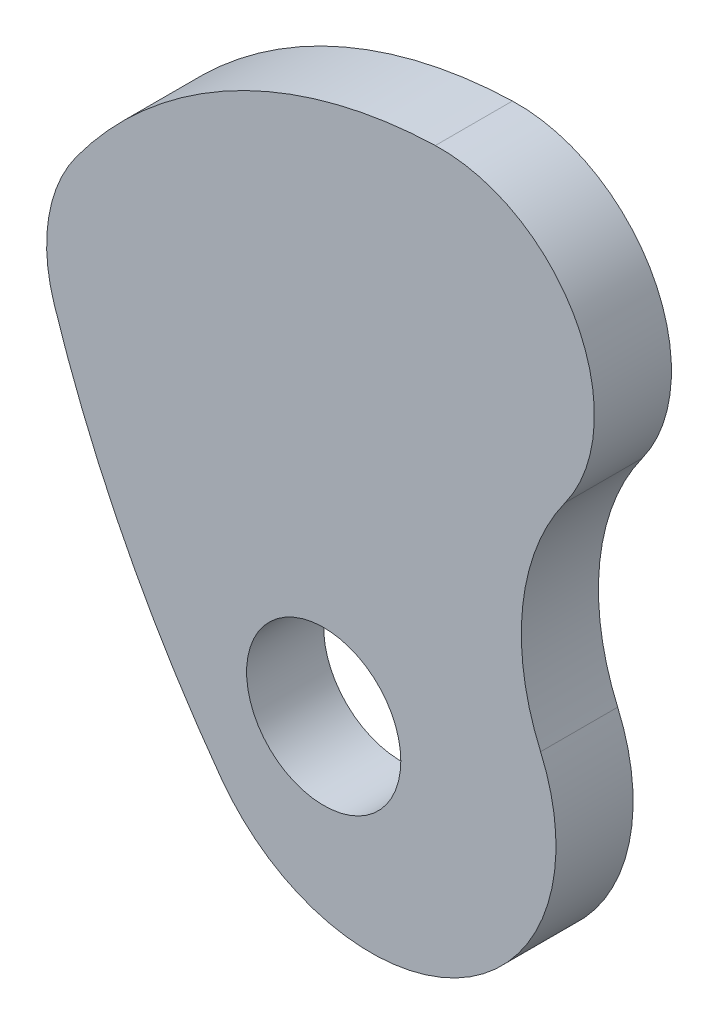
from build123d import *

# Parameters (mm, degrees)
SKETCH1_R      = 5
EXTRUDE2_DEPTH = 5


with BuildPart() as part:
    # Sketch1 → Extrude2 (new body)
    with BuildSketch(Plane.XY):
        with BuildLine():
            ThreePointArc((-17.482435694, 14.437829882), (-12.901534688, 3.368679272), (-6.616664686, -6.829906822))
            ThreePointArc((-6.616664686, -6.829906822), (9.043339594, -10.142686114), (14.064444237, 5.055956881))
            ThreePointArc((14.064444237, 5.055956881), (12.901477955, 12.65595689), (15.656667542, 19.833799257))
            ThreePointArc((15.656667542, 19.833799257), (16.383204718, 30.379854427), (7.240010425, 35.685430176))
            ThreePointArc((7.240010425, 35.685430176), (-5.814855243, 32.239348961), (-16.036327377, 23.417416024))
            ThreePointArc((-16.036327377, 23.417416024), (-17.839347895, 19.101545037), (-17.482435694, 14.437829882))
        make_face()
        Circle(SKETCH1_R, mode=Mode.SUBTRACT)
    extrude(amount=EXTRUDE2_DEPTH)


solid = part.part
